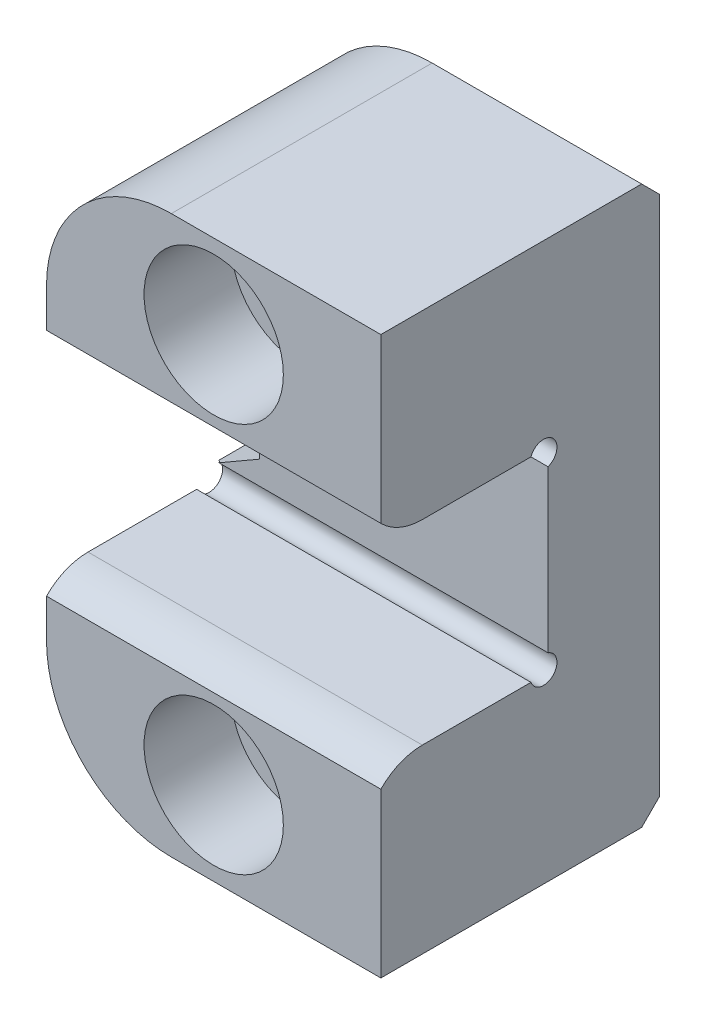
ISO-10303-21;
HEADER;
FILE_DESCRIPTION(('STEP AP214'),'2;1');
FILE_NAME('part.step','',(''),(''),'','','');
FILE_SCHEMA(('AUTOMOTIVE_DESIGN { 1 0 10303 214 1 1 1 1 }'));
ENDSEC;
DATA;
#1=APPLICATION_CONTEXT('core data for automotive mechanical design processes');
#2=APPLICATION_PROTOCOL_DEFINITION('international standard','automotive_design',2000,#1);
#3=PRODUCT_CONTEXT('',#1,'mechanical');
#4=PRODUCT('Part','Part','',(#3));
#5=PRODUCT_RELATED_PRODUCT_CATEGORY('part','',(#4));
#6=PRODUCT_DEFINITION_FORMATION('','',#4);
#7=PRODUCT_DEFINITION_CONTEXT('part definition',#1,'design');
#8=PRODUCT_DEFINITION('design','',#6,#7);
#9=PRODUCT_DEFINITION_SHAPE('','',#8);
#10=(LENGTH_UNIT() NAMED_UNIT(*) SI_UNIT(.MILLI.,.METRE.));
#11=(NAMED_UNIT(*) PLANE_ANGLE_UNIT() SI_UNIT($,.RADIAN.));
#12=(NAMED_UNIT(*) SI_UNIT($,.STERADIAN.) SOLID_ANGLE_UNIT());
#13=UNCERTAINTY_MEASURE_WITH_UNIT(LENGTH_MEASURE(1.E-05),#10,'distance_accuracy_value','');
#14=(GEOMETRIC_REPRESENTATION_CONTEXT(3) GLOBAL_UNCERTAINTY_ASSIGNED_CONTEXT((#13)) GLOBAL_UNIT_ASSIGNED_CONTEXT((#10,
#11,#12)) REPRESENTATION_CONTEXT('',''));
#15=CARTESIAN_POINT('',(0.,0.,0.));
#16=DIRECTION('',(0.,0.,1.));
#17=DIRECTION('',(1.,0.,0.));
#18=AXIS2_PLACEMENT_3D('',#15,#16,#17);
#19=CARTESIAN_POINT('',(9.525,5.5626,-9.525));
#20=DIRECTION('',(0.,0.,-1.));
#21=DIRECTION('',(-1.,0.,0.));
#22=AXIS2_PLACEMENT_3D('',#19,#20,#21);
#23=PLANE('',#22);
#24=DIRECTION('',(-0.866025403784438,0.500000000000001,0.));
#25=VECTOR('',#24,1.);
#26=CARTESIAN_POINT('',(4.41604653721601,-3.28636697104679,-9.525));
#27=LINE('',#26,#25);
#28=CARTESIAN_POINT('',(-6.91661357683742,3.25654739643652,-9.525));
#29=VERTEX_POINT('',#28);
#30=CARTESIAN_POINT('',(-9.22653215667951,4.59017951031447,-9.525));
#31=VERTEX_POINT('',#30);
#32=EDGE_CURVE('E342',#29,#31,#27,.T.);
#33=ORIENTED_EDGE('',*,*,#32,.F.);
#34=DIRECTION('',(0.,-1.,0.));
#35=VECTOR('',#34,1.);
#36=CARTESIAN_POINT('',(-6.91661357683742,-3.84595644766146,-9.525));
#37=LINE('',#36,#35);
#38=CARTESIAN_POINT('',(-6.91661357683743,-3.25654739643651,-9.525));
#39=VERTEX_POINT('',#38);
#40=EDGE_CURVE('E257',#29,#39,#37,.T.);
#41=ORIENTED_EDGE('',*,*,#40,.T.);
#42=DIRECTION('',(0.866025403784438,0.500000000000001,0.));
#43=VECTOR('',#42,1.);
#44=CARTESIAN_POINT('',(9.23339944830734,6.06766697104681,-9.525));
#45=LINE('',#44,#43);
#46=CARTESIAN_POINT('',(-9.22653215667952,-4.59017951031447,-9.525));
#47=VERTEX_POINT('',#46);
#48=EDGE_CURVE('E340',#47,#39,#45,.T.);
#49=ORIENTED_EDGE('',*,*,#48,.F.);
#50=DIRECTION('',(1.,0.,0.));
#51=VECTOR('',#50,1.);
#52=CARTESIAN_POINT('',(-9.525,-4.59017951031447,-9.525));
#53=LINE('',#52,#51);
#54=CARTESIAN_POINT('',(9.525,-4.59017951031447,-9.525));
#55=VERTEX_POINT('',#54);
#56=EDGE_CURVE('E200',#47,#55,#53,.T.);
#57=ORIENTED_EDGE('',*,*,#56,.T.);
#58=DIRECTION('',(0.,-1.,0.));
#59=VECTOR('',#58,1.);
#60=CARTESIAN_POINT('',(9.525,5.5626,-9.525));
#61=LINE('',#60,#59);
#62=CARTESIAN_POINT('',(9.525,4.59017951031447,-9.525));
#63=VERTEX_POINT('',#62);
#64=EDGE_CURVE('E350',#63,#55,#61,.T.);
#65=ORIENTED_EDGE('',*,*,#64,.F.);
#66=DIRECTION('',(1.,0.,0.));
#67=VECTOR('',#66,1.);
#68=CARTESIAN_POINT('',(-9.525,4.59017951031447,-9.525));
#69=LINE('',#68,#67);
#70=EDGE_CURVE('E413',#63,#31,#69,.F.);
#71=ORIENTED_EDGE('',*,*,#70,.T.);
#72=EDGE_LOOP('',(#33,#41,#49,#57,#65,#71));
#73=FACE_BOUND('',#72,.T.);
#74=ADVANCED_FACE('F32',(#73),#23,.F.);
#75=CARTESIAN_POINT('',(9.525,15.875,-15.875));
#76=DIRECTION('',(0.,0.,1.));
#77=DIRECTION('',(0.,-1.,0.));
#78=AXIS2_PLACEMENT_3D('',#75,#76,#77);
#79=PLANE('',#78);
#80=CARTESIAN_POINT('',(0.,11.1125,-15.875));
#81=DIRECTION('',(0.,0.,1.));
#82=DIRECTION('',(1.,0.,0.));
#83=AXIS2_PLACEMENT_3D('',#80,#81,#82);
#84=CIRCLE('',#83,2.45745);
#85=CARTESIAN_POINT('',(2.45745,11.1125,-15.875));
#86=VERTEX_POINT('',#85);
#87=EDGE_CURVE('E548',#86,#86,#84,.T.);
#88=ORIENTED_EDGE('',*,*,#87,.T.);
#89=EDGE_LOOP('',(#88));
#90=FACE_BOUND('',#89,.T.);
#91=CARTESIAN_POINT('',(0.,-11.1125,-15.875));
#92=DIRECTION('',(0.,0.,1.));
#93=DIRECTION('',(1.,0.,0.));
#94=AXIS2_PLACEMENT_3D('',#91,#92,#93);
#95=CIRCLE('',#94,2.45745);
#96=CARTESIAN_POINT('',(2.45745,-11.1125,-15.875));
#97=VERTEX_POINT('',#96);
#98=EDGE_CURVE('E560',#97,#97,#95,.T.);
#99=ORIENTED_EDGE('',*,*,#98,.T.);
#100=EDGE_LOOP('',(#99));
#101=FACE_BOUND('',#100,.T.);
#102=CARTESIAN_POINT('',(-2.413,-8.763,-15.875));
#103=DIRECTION('',(0.,0.,1.));
#104=DIRECTION('',(0.,-1.,0.));
#105=AXIS2_PLACEMENT_3D('',#102,#103,#104);
#106=CIRCLE('',#105,6.09600000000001);
#107=CARTESIAN_POINT('',(-2.413,-14.859,-15.875));
#108=VERTEX_POINT('',#107);
#109=CARTESIAN_POINT('',(-8.50900000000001,-8.763,-15.875));
#110=VERTEX_POINT('',#109);
#111=EDGE_CURVE('E273',#108,#110,#106,.F.);
#112=ORIENTED_EDGE('',*,*,#111,.T.);
#113=DIRECTION('',(0.,1.,0.));
#114=VECTOR('',#113,1.);
#115=CARTESIAN_POINT('',(-8.50900000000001,15.875,-15.875));
#116=LINE('',#115,#114);
#117=CARTESIAN_POINT('',(-8.50900000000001,-4.17591212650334,-15.875));
#118=VERTEX_POINT('',#117);
#119=EDGE_CURVE('E275',#110,#118,#116,.T.);
#120=ORIENTED_EDGE('',*,*,#119,.T.);
#121=DIRECTION('',(0.866025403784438,0.500000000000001,0.));
#122=VECTOR('',#121,1.);
#123=CARTESIAN_POINT('',(-7.9375,-3.84595644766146,-15.875));
#124=LINE('',#123,#122);
#125=CARTESIAN_POINT('',(-7.9375,-3.84595644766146,-15.875));
#126=VERTEX_POINT('',#125);
#127=EDGE_CURVE('E326',#118,#126,#124,.T.);
#128=ORIENTED_EDGE('',*,*,#127,.T.);
#129=DIRECTION('',(0.,1.,0.));
#130=VECTOR('',#129,1.);
#131=CARTESIAN_POINT('',(-7.9375,3.84595644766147,-15.875));
#132=LINE('',#131,#130);
#133=CARTESIAN_POINT('',(-7.9375,3.84595644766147,-15.875));
#134=VERTEX_POINT('',#133);
#135=EDGE_CURVE('E325',#126,#134,#132,.T.);
#136=ORIENTED_EDGE('',*,*,#135,.T.);
#137=DIRECTION('',(-0.866025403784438,0.500000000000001,0.));
#138=VECTOR('',#137,1.);
#139=CARTESIAN_POINT('',(-7.9375,3.84595644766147,-15.875));
#140=LINE('',#139,#138);
#141=CARTESIAN_POINT('',(-8.50900000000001,4.17591212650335,-15.875));
#142=VERTEX_POINT('',#141);
#143=EDGE_CURVE('E319',#134,#142,#140,.T.);
#144=ORIENTED_EDGE('',*,*,#143,.T.);
#145=DIRECTION('',(0.,1.,0.));
#146=VECTOR('',#145,1.);
#147=CARTESIAN_POINT('',(-8.50900000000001,15.875,-15.875));
#148=LINE('',#147,#146);
#149=CARTESIAN_POINT('',(-8.50900000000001,8.763,-15.875));
#150=VERTEX_POINT('',#149);
#151=EDGE_CURVE('E267',#142,#150,#148,.T.);
#152=ORIENTED_EDGE('',*,*,#151,.T.);
#153=CARTESIAN_POINT('',(-2.413,8.763,-15.875));
#154=DIRECTION('',(0.,0.,1.));
#155=DIRECTION('',(0.,-1.,0.));
#156=AXIS2_PLACEMENT_3D('',#153,#154,#155);
#157=CIRCLE('',#156,6.09600000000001);
#158=CARTESIAN_POINT('',(-2.413,14.859,-15.875));
#159=VERTEX_POINT('',#158);
#160=EDGE_CURVE('E265',#150,#159,#157,.F.);
#161=ORIENTED_EDGE('',*,*,#160,.T.);
#162=DIRECTION('',(1.,0.,0.));
#163=VECTOR('',#162,1.);
#164=CARTESIAN_POINT('',(9.525,14.859,-15.875));
#165=LINE('',#164,#163);
#166=CARTESIAN_POINT('',(9.525,14.859,-15.875));
#167=VERTEX_POINT('',#166);
#168=EDGE_CURVE('E269',#159,#167,#165,.T.);
#169=ORIENTED_EDGE('',*,*,#168,.T.);
#170=DIRECTION('',(0.,1.,0.));
#171=VECTOR('',#170,1.);
#172=CARTESIAN_POINT('',(9.525,15.875,-15.875));
#173=LINE('',#172,#171);
#174=CARTESIAN_POINT('',(9.525,-14.859,-15.875));
#175=VERTEX_POINT('',#174);
#176=EDGE_CURVE('E359',#175,#167,#173,.T.);
#177=ORIENTED_EDGE('',*,*,#176,.F.);
#178=DIRECTION('',(-1.,0.,0.));
#179=VECTOR('',#178,1.);
#180=CARTESIAN_POINT('',(9.525,-14.859,-15.875));
#181=LINE('',#180,#179);
#182=EDGE_CURVE('E271',#175,#108,#181,.T.);
#183=ORIENTED_EDGE('',*,*,#182,.T.);
#184=EDGE_LOOP('',(#112,#120,#128,#136,#144,#152,#161,#169,#177,#183));
#185=FACE_BOUND('',#184,.T.);
#186=ADVANCED_FACE('F323',(#90,#101,#185),#79,.F.);
#187=CARTESIAN_POINT('',(-9.525,15.875,0.));
#188=DIRECTION('',(1.,0.,0.));
#189=DIRECTION('',(0.,0.,-1.));
#190=AXIS2_PLACEMENT_3D('',#187,#188,#189);
#191=PLANE('',#190);
#192=DIRECTION('',(0.,0.,1.));
#193=VECTOR('',#192,1.);
#194=CARTESIAN_POINT('',(-9.525,8.763,0.));
#195=LINE('',#194,#193);
#196=CARTESIAN_POINT('',(-9.525,8.763,0.));
#197=VERTEX_POINT('',#196);
#198=CARTESIAN_POINT('',(-9.525,8.763,-14.859));
#199=VERTEX_POINT('',#198);
#200=EDGE_CURVE('E237',#197,#199,#195,.F.);
#201=ORIENTED_EDGE('',*,*,#200,.T.);
#202=DIRECTION('',(0.,-1.,0.));
#203=VECTOR('',#202,1.);
#204=CARTESIAN_POINT('',(-9.525,15.875,-14.859));
#205=LINE('',#204,#203);
#206=CARTESIAN_POINT('',(-9.525,4.76250000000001,-14.859));
#207=VERTEX_POINT('',#206);
#208=EDGE_CURVE('E54',#199,#207,#205,.T.);
#209=ORIENTED_EDGE('',*,*,#208,.T.);
#210=DIRECTION('',(0.,0.,-1.));
#211=VECTOR('',#210,1.);
#212=CARTESIAN_POINT('',(-9.525,4.76250000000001,0.));
#213=LINE('',#212,#211);
#214=CARTESIAN_POINT('',(-9.525,4.76250000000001,-9.80243088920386));
#215=VERTEX_POINT('',#214);
#216=EDGE_CURVE('E249',#215,#207,#213,.T.);
#217=ORIENTED_EDGE('',*,*,#216,.F.);
#218=CARTESIAN_POINT('',(-9.525,5.3086,-9.271));
#219=DIRECTION('',(1.,0.,0.));
#220=DIRECTION('',(0.,0.,-1.));
#221=AXIS2_PLACEMENT_3D('',#218,#219,#220);
#222=CIRCLE('',#221,0.762000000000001);
#223=CARTESIAN_POINT('',(-9.525,5.5626,-8.55257951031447));
#224=VERTEX_POINT('',#223);
#225=EDGE_CURVE('E417',#215,#224,#222,.T.);
#226=ORIENTED_EDGE('',*,*,#225,.T.);
#227=DIRECTION('',(0.,0.,-1.));
#228=VECTOR('',#227,1.);
#229=CARTESIAN_POINT('',(-9.525,5.5626,0.));
#230=LINE('',#229,#228);
#231=CARTESIAN_POINT('',(-9.525,5.5626,-2.36219999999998));
#232=VERTEX_POINT('',#231);
#233=EDGE_CURVE('E217',#232,#224,#230,.T.);
#234=ORIENTED_EDGE('',*,*,#233,.F.);
#235=CARTESIAN_POINT('',(-9.525,8.8617534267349,-2.36219999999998));
#236=DIRECTION('',(-1.,0.,0.));
#237=DIRECTION('',(0.,0.,-1.));
#238=AXIS2_PLACEMENT_3D('',#235,#236,#237);
#239=CIRCLE('',#238,3.2991534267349);
#240=CARTESIAN_POINT('',(-9.525,6.5586198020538,0.));
#241=VERTEX_POINT('',#240);
#242=EDGE_CURVE('E373',#232,#241,#239,.T.);
#243=ORIENTED_EDGE('',*,*,#242,.T.);
#244=DIRECTION('',(0.,-1.,0.));
#245=VECTOR('',#244,1.);
#246=CARTESIAN_POINT('',(-9.525,15.875,0.));
#247=LINE('',#246,#245);
#248=EDGE_CURVE('E223',#197,#241,#247,.T.);
#249=ORIENTED_EDGE('',*,*,#248,.F.);
#250=EDGE_LOOP('',(#201,#209,#217,#226,#234,#243,#249));
#251=FACE_BOUND('',#250,.T.);
#252=ADVANCED_FACE('F371',(#251),#191,.F.);
#253=DIRECTION('',(0.,0.,1.));
#254=VECTOR('',#253,1.);
#255=CARTESIAN_POINT('',(-9.525,-4.7625,0.));
#256=LINE('',#255,#254);
#257=CARTESIAN_POINT('',(-9.525,-4.7625,-14.859));
#258=VERTEX_POINT('',#257);
#259=CARTESIAN_POINT('',(-9.525,-4.7625,-9.80243088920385));
#260=VERTEX_POINT('',#259);
#261=EDGE_CURVE('E247',#258,#260,#256,.T.);
#262=ORIENTED_EDGE('',*,*,#261,.F.);
#263=DIRECTION('',(0.,-1.,0.));
#264=VECTOR('',#263,1.);
#265=CARTESIAN_POINT('',(-9.525,15.875,-14.859));
#266=LINE('',#265,#264);
#267=CARTESIAN_POINT('',(-9.525,-8.763,-14.859));
#268=VERTEX_POINT('',#267);
#269=EDGE_CURVE('E280',#258,#268,#266,.T.);
#270=ORIENTED_EDGE('',*,*,#269,.T.);
#271=DIRECTION('',(0.,0.,-1.));
#272=VECTOR('',#271,1.);
#273=CARTESIAN_POINT('',(-9.525,-8.763,0.));
#274=LINE('',#273,#272);
#275=CARTESIAN_POINT('',(-9.525,-8.763,0.));
#276=VERTEX_POINT('',#275);
#277=EDGE_CURVE('E239',#268,#276,#274,.F.);
#278=ORIENTED_EDGE('',*,*,#277,.T.);
#279=DIRECTION('',(0.,-1.,0.));
#280=VECTOR('',#279,1.);
#281=CARTESIAN_POINT('',(-9.525,-5.5626,0.));
#282=LINE('',#281,#280);
#283=CARTESIAN_POINT('',(-9.525,-6.5586198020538,0.));
#284=VERTEX_POINT('',#283);
#285=EDGE_CURVE('E216',#284,#276,#282,.T.);
#286=ORIENTED_EDGE('',*,*,#285,.F.);
#287=CARTESIAN_POINT('',(-9.525,-8.8617534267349,-2.36219999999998));
#288=DIRECTION('',(-1.,0.,0.));
#289=DIRECTION('',(0.,0.,1.));
#290=AXIS2_PLACEMENT_3D('',#287,#288,#289);
#291=CIRCLE('',#290,3.2991534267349);
#292=CARTESIAN_POINT('',(-9.525,-5.5626,-2.36219999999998));
#293=VERTEX_POINT('',#292);
#294=EDGE_CURVE('E215',#284,#293,#291,.T.);
#295=ORIENTED_EDGE('',*,*,#294,.T.);
#296=DIRECTION('',(0.,0.,1.));
#297=VECTOR('',#296,1.);
#298=CARTESIAN_POINT('',(-9.525,-5.5626,-9.525));
#299=LINE('',#298,#297);
#300=CARTESIAN_POINT('',(-9.525,-5.5626,-8.55257951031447));
#301=VERTEX_POINT('',#300);
#302=EDGE_CURVE('E207',#301,#293,#299,.T.);
#303=ORIENTED_EDGE('',*,*,#302,.F.);
#304=CARTESIAN_POINT('',(-9.525,-5.3086,-9.271));
#305=DIRECTION('',(1.,0.,0.));
#306=DIRECTION('',(0.,0.,1.));
#307=AXIS2_PLACEMENT_3D('',#304,#305,#306);
#308=CIRCLE('',#307,0.762000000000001);
#309=EDGE_CURVE('E190',#301,#260,#308,.T.);
#310=ORIENTED_EDGE('',*,*,#309,.T.);
#311=EDGE_LOOP('',(#262,#270,#278,#286,#295,#303,#310));
#312=FACE_BOUND('',#311,.T.);
#313=ADVANCED_FACE('F213',(#312),#191,.F.);
#314=CARTESIAN_POINT('',(9.525,15.875,0.));
#315=DIRECTION('',(0.,0.,-1.));
#316=DIRECTION('',(0.,1.,0.));
#317=AXIS2_PLACEMENT_3D('',#314,#315,#316);
#318=PLANE('',#317);
#319=CARTESIAN_POINT('',(0.,11.1125,0.));
#320=DIRECTION('',(0.,0.,1.));
#321=DIRECTION('',(1.,0.,0.));
#322=AXIS2_PLACEMENT_3D('',#319,#320,#321);
#323=CIRCLE('',#322,3.96875);
#324=CARTESIAN_POINT('',(3.96875,11.1125,0.));
#325=VERTEX_POINT('',#324);
#326=EDGE_CURVE('E300',#325,#325,#323,.T.);
#327=ORIENTED_EDGE('',*,*,#326,.F.);
#328=EDGE_LOOP('',(#327));
#329=FACE_BOUND('',#328,.T.);
#330=ORIENTED_EDGE('',*,*,#248,.T.);
#331=DIRECTION('',(1.,0.,0.));
#332=VECTOR('',#331,1.);
#333=CARTESIAN_POINT('',(-9.525,6.5586198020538,0.));
#334=LINE('',#333,#332);
#335=CARTESIAN_POINT('',(9.525,6.5586198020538,0.));
#336=VERTEX_POINT('',#335);
#337=EDGE_CURVE('E368',#241,#336,#334,.T.);
#338=ORIENTED_EDGE('',*,*,#337,.T.);
#339=DIRECTION('',(0.,-1.,0.));
#340=VECTOR('',#339,1.);
#341=CARTESIAN_POINT('',(9.525,15.875,0.));
#342=LINE('',#341,#340);
#343=CARTESIAN_POINT('',(9.525,15.875,0.));
#344=VERTEX_POINT('',#343);
#345=EDGE_CURVE('E220',#344,#336,#342,.T.);
#346=ORIENTED_EDGE('',*,*,#345,.F.);
#347=DIRECTION('',(-1.,0.,0.));
#348=VECTOR('',#347,1.);
#349=CARTESIAN_POINT('',(9.525,15.875,0.));
#350=LINE('',#349,#348);
#351=CARTESIAN_POINT('',(-2.413,15.875,0.));
#352=VERTEX_POINT('',#351);
#353=EDGE_CURVE('E227',#344,#352,#350,.T.);
#354=ORIENTED_EDGE('',*,*,#353,.T.);
#355=CARTESIAN_POINT('',(-2.413,8.763,0.));
#356=DIRECTION('',(0.,0.,-1.));
#357=DIRECTION('',(0.,1.,0.));
#358=AXIS2_PLACEMENT_3D('',#355,#356,#357);
#359=CIRCLE('',#358,7.112);
#360=EDGE_CURVE('E245',#352,#197,#359,.F.);
#361=ORIENTED_EDGE('',*,*,#360,.T.);
#362=EDGE_LOOP('',(#330,#338,#346,#354,#361));
#363=FACE_BOUND('',#362,.T.);
#364=ADVANCED_FACE('F366',(#329,#363),#318,.F.);
#365=CARTESIAN_POINT('',(9.525,5.5626,0.));
#366=DIRECTION('',(0.,1.,0.));
#367=DIRECTION('',(0.,0.,1.));
#368=AXIS2_PLACEMENT_3D('',#365,#366,#367);
#369=PLANE('',#368);
#370=ORIENTED_EDGE('',*,*,#233,.T.);
#371=DIRECTION('',(1.,0.,0.));
#372=VECTOR('',#371,1.);
#373=CARTESIAN_POINT('',(-9.525,5.5626,-8.55257951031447));
#374=LINE('',#373,#372);
#375=CARTESIAN_POINT('',(9.525,5.5626,-8.55257951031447));
#376=VERTEX_POINT('',#375);
#377=EDGE_CURVE('E416',#224,#376,#374,.T.);
#378=ORIENTED_EDGE('',*,*,#377,.T.);
#379=DIRECTION('',(0.,0.,-1.));
#380=VECTOR('',#379,1.);
#381=CARTESIAN_POINT('',(9.525,5.5626,0.));
#382=LINE('',#381,#380);
#383=CARTESIAN_POINT('',(9.525,5.5626,-2.36219999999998));
#384=VERTEX_POINT('',#383);
#385=EDGE_CURVE('E347',#384,#376,#382,.T.);
#386=ORIENTED_EDGE('',*,*,#385,.F.);
#387=DIRECTION('',(1.,0.,0.));
#388=VECTOR('',#387,1.);
#389=CARTESIAN_POINT('',(-9.525,5.5626,-2.36219999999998));
#390=LINE('',#389,#388);
#391=EDGE_CURVE('E428',#232,#384,#390,.T.);
#392=ORIENTED_EDGE('',*,*,#391,.F.);
#393=EDGE_LOOP('',(#370,#378,#386,#392));
#394=FACE_BOUND('',#393,.T.);
#395=ADVANCED_FACE('F470',(#394),#369,.F.);
#396=CARTESIAN_POINT('',(9.525,-5.5626,-9.525));
#397=DIRECTION('',(0.,-1.,0.));
#398=DIRECTION('',(0.,0.,-1.));
#399=AXIS2_PLACEMENT_3D('',#396,#397,#398);
#400=PLANE('',#399);
#401=DIRECTION('',(0.,0.,1.));
#402=VECTOR('',#401,1.);
#403=CARTESIAN_POINT('',(9.525,-5.5626,-9.525));
#404=LINE('',#403,#402);
#405=CARTESIAN_POINT('',(9.525,-5.5626,-8.55257951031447));
#406=VERTEX_POINT('',#405);
#407=CARTESIAN_POINT('',(9.525,-5.5626,-2.36219999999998));
#408=VERTEX_POINT('',#407);
#409=EDGE_CURVE('E209',#406,#408,#404,.T.);
#410=ORIENTED_EDGE('',*,*,#409,.F.);
#411=DIRECTION('',(1.,0.,0.));
#412=VECTOR('',#411,1.);
#413=CARTESIAN_POINT('',(-9.525,-5.5626,-8.55257951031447));
#414=LINE('',#413,#412);
#415=EDGE_CURVE('E193',#406,#301,#414,.F.);
#416=ORIENTED_EDGE('',*,*,#415,.T.);
#417=ORIENTED_EDGE('',*,*,#302,.T.);
#418=DIRECTION('',(1.,0.,0.));
#419=VECTOR('',#418,1.);
#420=CARTESIAN_POINT('',(-9.525,-5.5626,-2.36219999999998));
#421=LINE('',#420,#419);
#422=EDGE_CURVE('E330',#293,#408,#421,.T.);
#423=ORIENTED_EDGE('',*,*,#422,.T.);
#424=EDGE_LOOP('',(#410,#416,#417,#423));
#425=FACE_BOUND('',#424,.T.);
#426=ADVANCED_FACE('F205',(#425),#400,.F.);
#427=CARTESIAN_POINT('',(9.525,-5.5626,0.));
#428=DIRECTION('',(0.,0.,-1.));
#429=DIRECTION('',(0.,1.,0.));
#430=AXIS2_PLACEMENT_3D('',#427,#428,#429);
#431=PLANE('',#430);
#432=CARTESIAN_POINT('',(0.,-11.1125,0.));
#433=DIRECTION('',(0.,0.,1.));
#434=DIRECTION('',(1.,0.,0.));
#435=AXIS2_PLACEMENT_3D('',#432,#433,#434);
#436=CIRCLE('',#435,3.96875);
#437=CARTESIAN_POINT('',(3.96875,-11.1125,0.));
#438=VERTEX_POINT('',#437);
#439=EDGE_CURVE('E545',#438,#438,#436,.T.);
#440=ORIENTED_EDGE('',*,*,#439,.F.);
#441=EDGE_LOOP('',(#440));
#442=FACE_BOUND('',#441,.T.);
#443=DIRECTION('',(0.,-1.,0.));
#444=VECTOR('',#443,1.);
#445=CARTESIAN_POINT('',(9.525,-5.5626,0.));
#446=LINE('',#445,#444);
#447=CARTESIAN_POINT('',(9.525,-6.5586198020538,0.));
#448=VERTEX_POINT('',#447);
#449=CARTESIAN_POINT('',(9.525,-15.875,0.));
#450=VERTEX_POINT('',#449);
#451=EDGE_CURVE('E354',#448,#450,#446,.T.);
#452=ORIENTED_EDGE('',*,*,#451,.F.);
#453=DIRECTION('',(1.,0.,0.));
#454=VECTOR('',#453,1.);
#455=CARTESIAN_POINT('',(-9.525,-6.5586198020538,0.));
#456=LINE('',#455,#454);
#457=EDGE_CURVE('E327',#284,#448,#456,.T.);
#458=ORIENTED_EDGE('',*,*,#457,.F.);
#459=ORIENTED_EDGE('',*,*,#285,.T.);
#460=CARTESIAN_POINT('',(-2.413,-8.763,0.));
#461=DIRECTION('',(0.,0.,-1.));
#462=DIRECTION('',(0.,1.,0.));
#463=AXIS2_PLACEMENT_3D('',#460,#461,#462);
#464=CIRCLE('',#463,7.112);
#465=CARTESIAN_POINT('',(-2.413,-15.875,0.));
#466=VERTEX_POINT('',#465);
#467=EDGE_CURVE('E241',#276,#466,#464,.F.);
#468=ORIENTED_EDGE('',*,*,#467,.T.);
#469=DIRECTION('',(-1.,0.,0.));
#470=VECTOR('',#469,1.);
#471=CARTESIAN_POINT('',(9.525,-15.875,0.));
#472=LINE('',#471,#470);
#473=EDGE_CURVE('E230',#450,#466,#472,.T.);
#474=ORIENTED_EDGE('',*,*,#473,.F.);
#475=EDGE_LOOP('',(#452,#458,#459,#468,#474));
#476=FACE_BOUND('',#475,.T.);
#477=ADVANCED_FACE('F441',(#442,#476),#431,.F.);
#478=CARTESIAN_POINT('',(9.525,-15.875,0.));
#479=DIRECTION('',(0.,1.,0.));
#480=DIRECTION('',(0.,0.,1.));
#481=AXIS2_PLACEMENT_3D('',#478,#479,#480);
#482=PLANE('',#481);
#483=DIRECTION('',(0.,0.,-1.));
#484=VECTOR('',#483,1.);
#485=CARTESIAN_POINT('',(-2.413,-15.875,0.));
#486=LINE('',#485,#484);
#487=CARTESIAN_POINT('',(-2.413,-15.875,-14.859));
#488=VERTEX_POINT('',#487);
#489=EDGE_CURVE('E234',#466,#488,#486,.T.);
#490=ORIENTED_EDGE('',*,*,#489,.T.);
#491=DIRECTION('',(1.,0.,0.));
#492=VECTOR('',#491,1.);
#493=CARTESIAN_POINT('',(9.525,-15.875,-14.859));
#494=LINE('',#493,#492);
#495=CARTESIAN_POINT('',(9.525,-15.875,-14.859));
#496=VERTEX_POINT('',#495);
#497=EDGE_CURVE('E284',#488,#496,#494,.T.);
#498=ORIENTED_EDGE('',*,*,#497,.T.);
#499=DIRECTION('',(0.,0.,-1.));
#500=VECTOR('',#499,1.);
#501=CARTESIAN_POINT('',(9.525,-15.875,0.));
#502=LINE('',#501,#500);
#503=EDGE_CURVE('E356',#450,#496,#502,.T.);
#504=ORIENTED_EDGE('',*,*,#503,.F.);
#505=ORIENTED_EDGE('',*,*,#473,.T.);
#506=EDGE_LOOP('',(#490,#498,#504,#505));
#507=FACE_BOUND('',#506,.T.);
#508=ADVANCED_FACE('F446',(#507),#482,.F.);
#509=CARTESIAN_POINT('',(9.525,15.875,0.));
#510=DIRECTION('',(0.,-1.,0.));
#511=DIRECTION('',(0.,0.,-1.));
#512=AXIS2_PLACEMENT_3D('',#509,#510,#511);
#513=PLANE('',#512);
#514=DIRECTION('',(0.,0.,1.));
#515=VECTOR('',#514,1.);
#516=CARTESIAN_POINT('',(9.525,15.875,0.));
#517=LINE('',#516,#515);
#518=CARTESIAN_POINT('',(9.525,15.875,-14.859));
#519=VERTEX_POINT('',#518);
#520=EDGE_CURVE('E231',#519,#344,#517,.T.);
#521=ORIENTED_EDGE('',*,*,#520,.F.);
#522=DIRECTION('',(-1.,0.,0.));
#523=VECTOR('',#522,1.);
#524=CARTESIAN_POINT('',(9.525,15.875,-14.859));
#525=LINE('',#524,#523);
#526=CARTESIAN_POINT('',(-2.413,15.875,-14.859));
#527=VERTEX_POINT('',#526);
#528=EDGE_CURVE('E290',#519,#527,#525,.T.);
#529=ORIENTED_EDGE('',*,*,#528,.T.);
#530=DIRECTION('',(0.,0.,1.));
#531=VECTOR('',#530,1.);
#532=CARTESIAN_POINT('',(-2.413,15.875,0.));
#533=LINE('',#532,#531);
#534=EDGE_CURVE('E243',#527,#352,#533,.T.);
#535=ORIENTED_EDGE('',*,*,#534,.T.);
#536=ORIENTED_EDGE('',*,*,#353,.F.);
#537=EDGE_LOOP('',(#521,#529,#535,#536));
#538=FACE_BOUND('',#537,.T.);
#539=ADVANCED_FACE('F378',(#538),#513,.F.);
#540=CARTESIAN_POINT('',(9.525,15.875,0.));
#541=DIRECTION('',(1.,0.,0.));
#542=DIRECTION('',(0.,0.,-1.));
#543=AXIS2_PLACEMENT_3D('',#540,#541,#542);
#544=PLANE('',#543);
#545=ORIENTED_EDGE('',*,*,#503,.T.);
#546=DIRECTION('',(0.,-0.707106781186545,0.70710678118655));
#547=VECTOR('',#546,1.);
#548=CARTESIAN_POINT('',(9.525,-7.4295000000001,-23.3044999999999));
#549=LINE('',#548,#547);
#550=EDGE_CURVE('E288',#496,#175,#549,.F.);
#551=ORIENTED_EDGE('',*,*,#550,.T.);
#552=ORIENTED_EDGE('',*,*,#176,.T.);
#553=DIRECTION('',(0.,-0.707106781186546,-0.707106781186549));
#554=VECTOR('',#553,1.);
#555=CARTESIAN_POINT('',(9.525,23.3045,-7.42949999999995));
#556=LINE('',#555,#554);
#557=EDGE_CURVE('E286',#167,#519,#556,.F.);
#558=ORIENTED_EDGE('',*,*,#557,.T.);
#559=ORIENTED_EDGE('',*,*,#520,.T.);
#560=ORIENTED_EDGE('',*,*,#345,.T.);
#561=CARTESIAN_POINT('',(9.525,8.8617534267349,-2.36219999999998));
#562=DIRECTION('',(-1.,0.,0.));
#563=DIRECTION('',(0.,0.,-1.));
#564=AXIS2_PLACEMENT_3D('',#561,#562,#563);
#565=CIRCLE('',#564,3.2991534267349);
#566=EDGE_CURVE('E420',#384,#336,#565,.T.);
#567=ORIENTED_EDGE('',*,*,#566,.F.);
#568=ORIENTED_EDGE('',*,*,#385,.T.);
#569=CARTESIAN_POINT('',(9.525,5.3086,-9.271));
#570=DIRECTION('',(1.,0.,0.));
#571=DIRECTION('',(0.,0.,-1.));
#572=AXIS2_PLACEMENT_3D('',#569,#570,#571);
#573=CIRCLE('',#572,0.762000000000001);
#574=EDGE_CURVE('E210',#63,#376,#573,.T.);
#575=ORIENTED_EDGE('',*,*,#574,.F.);
#576=ORIENTED_EDGE('',*,*,#64,.T.);
#577=CARTESIAN_POINT('',(9.525,-5.3086,-9.271));
#578=DIRECTION('',(1.,0.,0.));
#579=DIRECTION('',(0.,0.,1.));
#580=AXIS2_PLACEMENT_3D('',#577,#578,#579);
#581=CIRCLE('',#580,0.762000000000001);
#582=EDGE_CURVE('E201',#406,#55,#581,.T.);
#583=ORIENTED_EDGE('',*,*,#582,.F.);
#584=ORIENTED_EDGE('',*,*,#409,.T.);
#585=CARTESIAN_POINT('',(9.525,-8.8617534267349,-2.36219999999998));
#586=DIRECTION('',(-1.,0.,0.));
#587=DIRECTION('',(0.,0.,1.));
#588=AXIS2_PLACEMENT_3D('',#585,#586,#587);
#589=CIRCLE('',#588,3.2991534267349);
#590=EDGE_CURVE('E430',#448,#408,#589,.T.);
#591=ORIENTED_EDGE('',*,*,#590,.F.);
#592=ORIENTED_EDGE('',*,*,#451,.T.);
#593=EDGE_LOOP('',(#545,#551,#552,#558,#559,#560,#567,#568,#575,#576,#583,#584,#591,#592));
#594=FACE_BOUND('',#593,.T.);
#595=ADVANCED_FACE('F382',(#594),#544,.T.);
#596=CARTESIAN_POINT('',(-2.413,-8.763,0.));
#597=DIRECTION('',(0.,0.,-1.));
#598=DIRECTION('',(-1.,0.,0.));
#599=AXIS2_PLACEMENT_3D('',#596,#597,#598);
#600=CYLINDRICAL_SURFACE('',#599,7.112);
#601=ORIENTED_EDGE('',*,*,#277,.F.);
#602=CARTESIAN_POINT('',(-2.413,-8.763,-14.859));
#603=DIRECTION('',(0.,0.,1.));
#604=DIRECTION('',(1.,0.,0.));
#605=AXIS2_PLACEMENT_3D('',#602,#603,#604);
#606=CIRCLE('',#605,7.112);
#607=EDGE_CURVE('E282',#268,#488,#606,.T.);
#608=ORIENTED_EDGE('',*,*,#607,.T.);
#609=ORIENTED_EDGE('',*,*,#489,.F.);
#610=ORIENTED_EDGE('',*,*,#467,.F.);
#611=EDGE_LOOP('',(#601,#608,#609,#610));
#612=FACE_BOUND('',#611,.T.);
#613=ADVANCED_FACE('F449',(#612),#600,.T.);
#614=CARTESIAN_POINT('',(-2.413,8.763,0.));
#615=DIRECTION('',(0.,0.,1.));
#616=DIRECTION('',(0.,-1.,0.));
#617=AXIS2_PLACEMENT_3D('',#614,#615,#616);
#618=CYLINDRICAL_SURFACE('',#617,7.112);
#619=ORIENTED_EDGE('',*,*,#534,.F.);
#620=CARTESIAN_POINT('',(-2.413,8.763,-14.859));
#621=DIRECTION('',(0.,0.,1.));
#622=DIRECTION('',(1.,0.,0.));
#623=AXIS2_PLACEMENT_3D('',#620,#621,#622);
#624=CIRCLE('',#623,7.112);
#625=EDGE_CURVE('E11',#527,#199,#624,.T.);
#626=ORIENTED_EDGE('',*,*,#625,.T.);
#627=ORIENTED_EDGE('',*,*,#200,.F.);
#628=ORIENTED_EDGE('',*,*,#360,.F.);
#629=EDGE_LOOP('',(#619,#626,#627,#628));
#630=FACE_BOUND('',#629,.T.);
#631=ADVANCED_FACE('F374',(#630),#618,.T.);
#632=CARTESIAN_POINT('',(-7.9375,3.84595644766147,0.));
#633=DIRECTION('',(-1.,0.,0.));
#634=DIRECTION('',(0.,0.,1.));
#635=AXIS2_PLACEMENT_3D('',#632,#633,#634);
#636=PLANE('',#635);
#637=DIRECTION('',(0.,0.,-1.));
#638=VECTOR('',#637,1.);
#639=CARTESIAN_POINT('',(-7.9375,-3.84595644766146,0.));
#640=LINE('',#639,#638);
#641=CARTESIAN_POINT('',(-7.9375,-3.84595644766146,-13.335));
#642=VERTEX_POINT('',#641);
#643=EDGE_CURVE('E337',#642,#126,#640,.T.);
#644=ORIENTED_EDGE('',*,*,#643,.F.);
#645=DIRECTION('',(0.,1.,0.));
#646=VECTOR('',#645,1.);
#647=CARTESIAN_POINT('',(-7.9375,3.84595644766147,-13.335));
#648=LINE('',#647,#646);
#649=CARTESIAN_POINT('',(-7.9375,3.84595644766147,-13.335));
#650=VERTEX_POINT('',#649);
#651=EDGE_CURVE('E254',#642,#650,#648,.T.);
#652=ORIENTED_EDGE('',*,*,#651,.T.);
#653=DIRECTION('',(0.,0.,-1.));
#654=VECTOR('',#653,1.);
#655=CARTESIAN_POINT('',(-7.9375,3.84595644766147,0.));
#656=LINE('',#655,#654);
#657=EDGE_CURVE('E335',#650,#134,#656,.T.);
#658=ORIENTED_EDGE('',*,*,#657,.T.);
#659=ORIENTED_EDGE('',*,*,#135,.F.);
#660=EDGE_LOOP('',(#644,#652,#658,#659));
#661=FACE_BOUND('',#660,.T.);
#662=ADVANCED_FACE('F404',(#661),#636,.T.);
#663=CARTESIAN_POINT('',(-7.9375,3.84595644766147,0.));
#664=DIRECTION('',(-0.500000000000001,-0.866025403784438,0.));
#665=DIRECTION('',(0.866025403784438,-0.500000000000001,0.));
#666=AXIS2_PLACEMENT_3D('',#663,#664,#665);
#667=PLANE('',#666);
#668=ORIENTED_EDGE('',*,*,#216,.T.);
#669=DIRECTION('',(-0.654653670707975,0.377964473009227,0.654653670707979));
#670=VECTOR('',#669,1.);
#671=CARTESIAN_POINT('',(-14.986,7.91540982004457,-9.39799999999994));
#672=LINE('',#671,#670);
#673=EDGE_CURVE('E41',#207,#142,#672,.F.);
#674=ORIENTED_EDGE('',*,*,#673,.T.);
#675=ORIENTED_EDGE('',*,*,#143,.F.);
#676=ORIENTED_EDGE('',*,*,#657,.F.);
#677=DIRECTION('',(0.255976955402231,-0.147788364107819,0.955319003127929));
#678=VECTOR('',#677,1.);
#679=CARTESIAN_POINT('',(-7.9375,3.84595644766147,-13.335));
#680=LINE('',#679,#678);
#681=EDGE_CURVE('E260',#650,#29,#680,.T.);
#682=ORIENTED_EDGE('',*,*,#681,.T.);
#683=ORIENTED_EDGE('',*,*,#32,.T.);
#684=CARTESIAN_POINT('',(-10.4708729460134,5.3086,-9.271));
#685=DIRECTION('',(-0.500000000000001,-0.866025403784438,0.));
#686=DIRECTION('',(0.866025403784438,-0.500000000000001,0.));
#687=AXIS2_PLACEMENT_3D('',#684,#685,#686);
#688=ELLIPSE('',#687,1.524,0.762000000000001);
#689=EDGE_CURVE('E251',#215,#31,#688,.T.);
#690=ORIENTED_EDGE('',*,*,#689,.F.);
#691=EDGE_LOOP('',(#668,#674,#675,#676,#682,#683,#690));
#692=FACE_BOUND('',#691,.T.);
#693=ADVANCED_FACE('F317',(#692),#667,.T.);
#694=CARTESIAN_POINT('',(-7.9375,-3.84595644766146,0.));
#695=DIRECTION('',(-0.500000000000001,0.866025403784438,0.));
#696=DIRECTION('',(-0.866025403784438,-0.500000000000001,0.));
#697=AXIS2_PLACEMENT_3D('',#694,#695,#696);
#698=PLANE('',#697);
#699=ORIENTED_EDGE('',*,*,#127,.F.);
#700=DIRECTION('',(0.654653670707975,0.377964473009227,-0.654653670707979));
#701=VECTOR('',#700,1.);
#702=CARTESIAN_POINT('',(-14.986,-7.91540982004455,-9.39799999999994));
#703=LINE('',#702,#701);
#704=EDGE_CURVE('E278',#118,#258,#703,.F.);
#705=ORIENTED_EDGE('',*,*,#704,.T.);
#706=ORIENTED_EDGE('',*,*,#261,.T.);
#707=CARTESIAN_POINT('',(-10.4708729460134,-5.3086,-9.271));
#708=DIRECTION('',(-0.500000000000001,0.866025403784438,0.));
#709=DIRECTION('',(0.866025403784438,0.500000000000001,0.));
#710=AXIS2_PLACEMENT_3D('',#707,#708,#709);
#711=ELLIPSE('',#710,1.524,0.762000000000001);
#712=EDGE_CURVE('E196',#47,#260,#711,.T.);
#713=ORIENTED_EDGE('',*,*,#712,.F.);
#714=ORIENTED_EDGE('',*,*,#48,.T.);
#715=DIRECTION('',(-0.255976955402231,-0.147788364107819,-0.955319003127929));
#716=VECTOR('',#715,1.);
#717=CARTESIAN_POINT('',(-7.64651173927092,-3.67795429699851,-12.249017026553));
#718=LINE('',#717,#716);
#719=EDGE_CURVE('E263',#39,#642,#718,.T.);
#720=ORIENTED_EDGE('',*,*,#719,.T.);
#721=ORIENTED_EDGE('',*,*,#643,.T.);
#722=EDGE_LOOP('',(#699,#705,#706,#713,#714,#720,#721));
#723=FACE_BOUND('',#722,.T.);
#724=ADVANCED_FACE('F399',(#723),#698,.T.);
#725=CARTESIAN_POINT('',(-9.525,-8.8617534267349,-2.36219999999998));
#726=DIRECTION('',(1.,0.,0.));
#727=DIRECTION('',(0.,0.,-1.));
#728=AXIS2_PLACEMENT_3D('',#725,#726,#727);
#729=CYLINDRICAL_SURFACE('',#728,3.2991534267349);
#730=ORIENTED_EDGE('',*,*,#590,.T.);
#731=ORIENTED_EDGE('',*,*,#422,.F.);
#732=ORIENTED_EDGE('',*,*,#294,.F.);
#733=ORIENTED_EDGE('',*,*,#457,.T.);
#734=EDGE_LOOP('',(#730,#731,#732,#733));
#735=FACE_BOUND('',#734,.T.);
#736=ADVANCED_FACE('F436',(#735),#729,.T.);
#737=CARTESIAN_POINT('',(-9.525,8.8617534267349,-2.36219999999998));
#738=DIRECTION('',(1.,0.,0.));
#739=DIRECTION('',(0.,0.,-1.));
#740=AXIS2_PLACEMENT_3D('',#737,#738,#739);
#741=CYLINDRICAL_SURFACE('',#740,3.2991534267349);
#742=ORIENTED_EDGE('',*,*,#566,.T.);
#743=ORIENTED_EDGE('',*,*,#337,.F.);
#744=ORIENTED_EDGE('',*,*,#242,.F.);
#745=ORIENTED_EDGE('',*,*,#391,.T.);
#746=EDGE_LOOP('',(#742,#743,#744,#745));
#747=FACE_BOUND('',#746,.T.);
#748=ADVANCED_FACE('F519',(#747),#741,.T.);
#749=CARTESIAN_POINT('',(-9.525,5.3086,-9.271));
#750=DIRECTION('',(1.,0.,0.));
#751=DIRECTION('',(0.,0.,-1.));
#752=AXIS2_PLACEMENT_3D('',#749,#750,#751);
#753=CYLINDRICAL_SURFACE('',#752,0.762000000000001);
#754=ORIENTED_EDGE('',*,*,#225,.F.);
#755=ORIENTED_EDGE('',*,*,#689,.T.);
#756=ORIENTED_EDGE('',*,*,#70,.F.);
#757=ORIENTED_EDGE('',*,*,#574,.T.);
#758=ORIENTED_EDGE('',*,*,#377,.F.);
#759=EDGE_LOOP('',(#754,#755,#756,#757,#758));
#760=FACE_BOUND('',#759,.T.);
#761=ADVANCED_FACE('F516',(#760),#753,.F.);
#762=CARTESIAN_POINT('',(-9.525,-5.3086,-9.271));
#763=DIRECTION('',(1.,0.,0.));
#764=DIRECTION('',(0.,0.,-1.));
#765=AXIS2_PLACEMENT_3D('',#762,#763,#764);
#766=CYLINDRICAL_SURFACE('',#765,0.762000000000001);
#767=ORIENTED_EDGE('',*,*,#582,.T.);
#768=ORIENTED_EDGE('',*,*,#56,.F.);
#769=ORIENTED_EDGE('',*,*,#712,.T.);
#770=ORIENTED_EDGE('',*,*,#309,.F.);
#771=ORIENTED_EDGE('',*,*,#415,.F.);
#772=EDGE_LOOP('',(#767,#768,#769,#770,#771));
#773=FACE_BOUND('',#772,.T.);
#774=ADVANCED_FACE('F192',(#773),#766,.F.);
#775=CARTESIAN_POINT('',(0.,-11.1125,0.));
#776=DIRECTION('',(0.,0.,1.));
#777=DIRECTION('',(1.,0.,0.));
#778=AXIS2_PLACEMENT_3D('',#775,#776,#777);
#779=CYLINDRICAL_SURFACE('',#778,2.45745);
#780=ORIENTED_EDGE('',*,*,#98,.F.);
#781=EDGE_LOOP('',(#780));
#782=FACE_BOUND('',#781,.T.);
#783=CARTESIAN_POINT('',(0.,-11.1125,-4.96062));
#784=DIRECTION('',(0.,0.,1.));
#785=DIRECTION('',(1.,0.,0.));
#786=AXIS2_PLACEMENT_3D('',#783,#784,#785);
#787=CIRCLE('',#786,2.45745);
#788=CARTESIAN_POINT('',(2.45745,-11.1125,-4.96062));
#789=VERTEX_POINT('',#788);
#790=EDGE_CURVE('E551',#789,#789,#787,.T.);
#791=ORIENTED_EDGE('',*,*,#790,.T.);
#792=EDGE_LOOP('',(#791));
#793=FACE_BOUND('',#792,.T.);
#794=ADVANCED_FACE('F509',(#782,#793),#779,.F.);
#795=CARTESIAN_POINT('',(2.45745,-11.1125,-4.96062));
#796=DIRECTION('',(0.,0.,-1.));
#797=DIRECTION('',(-1.,0.,0.));
#798=AXIS2_PLACEMENT_3D('',#795,#796,#797);
#799=PLANE('',#798);
#800=ORIENTED_EDGE('',*,*,#790,.F.);
#801=EDGE_LOOP('',(#800));
#802=FACE_BOUND('',#801,.T.);
#803=CARTESIAN_POINT('',(0.,-11.1125,-4.96062));
#804=DIRECTION('',(0.,0.,1.));
#805=DIRECTION('',(1.,0.,0.));
#806=AXIS2_PLACEMENT_3D('',#803,#804,#805);
#807=CIRCLE('',#806,3.96875);
#808=CARTESIAN_POINT('',(3.96875,-11.1125,-4.96062));
#809=VERTEX_POINT('',#808);
#810=EDGE_CURVE('E547',#809,#809,#807,.T.);
#811=ORIENTED_EDGE('',*,*,#810,.T.);
#812=EDGE_LOOP('',(#811));
#813=FACE_BOUND('',#812,.T.);
#814=ADVANCED_FACE('F505',(#802,#813),#799,.F.);
#815=CARTESIAN_POINT('',(0.,-11.1125,0.));
#816=DIRECTION('',(0.,0.,1.));
#817=DIRECTION('',(1.,0.,0.));
#818=AXIS2_PLACEMENT_3D('',#815,#816,#817);
#819=CYLINDRICAL_SURFACE('',#818,3.96875);
#820=ORIENTED_EDGE('',*,*,#810,.F.);
#821=EDGE_LOOP('',(#820));
#822=FACE_BOUND('',#821,.T.);
#823=ORIENTED_EDGE('',*,*,#439,.T.);
#824=EDGE_LOOP('',(#823));
#825=FACE_BOUND('',#824,.T.);
#826=ADVANCED_FACE('F501',(#822,#825),#819,.F.);
#827=CARTESIAN_POINT('',(0.,11.1125,0.));
#828=DIRECTION('',(0.,0.,1.));
#829=DIRECTION('',(1.,0.,0.));
#830=AXIS2_PLACEMENT_3D('',#827,#828,#829);
#831=CYLINDRICAL_SURFACE('',#830,2.45745);
#832=ORIENTED_EDGE('',*,*,#87,.F.);
#833=EDGE_LOOP('',(#832));
#834=FACE_BOUND('',#833,.T.);
#835=CARTESIAN_POINT('',(0.,11.1125,-4.96062));
#836=DIRECTION('',(0.,0.,1.));
#837=DIRECTION('',(1.,0.,0.));
#838=AXIS2_PLACEMENT_3D('',#835,#836,#837);
#839=CIRCLE('',#838,2.45745);
#840=CARTESIAN_POINT('',(2.45745,11.1125,-4.96062));
#841=VERTEX_POINT('',#840);
#842=EDGE_CURVE('E554',#841,#841,#839,.T.);
#843=ORIENTED_EDGE('',*,*,#842,.T.);
#844=EDGE_LOOP('',(#843));
#845=FACE_BOUND('',#844,.T.);
#846=ADVANCED_FACE('F493',(#834,#845),#831,.F.);
#847=CARTESIAN_POINT('',(2.45745,11.1125,-4.96062));
#848=DIRECTION('',(0.,0.,-1.));
#849=DIRECTION('',(-1.,0.,0.));
#850=AXIS2_PLACEMENT_3D('',#847,#848,#849);
#851=PLANE('',#850);
#852=ORIENTED_EDGE('',*,*,#842,.F.);
#853=EDGE_LOOP('',(#852));
#854=FACE_BOUND('',#853,.T.);
#855=CARTESIAN_POINT('',(0.,11.1125,-4.96062));
#856=DIRECTION('',(0.,0.,1.));
#857=DIRECTION('',(1.,0.,0.));
#858=AXIS2_PLACEMENT_3D('',#855,#856,#857);
#859=CIRCLE('',#858,3.96875);
#860=CARTESIAN_POINT('',(3.96875,11.1125,-4.96062));
#861=VERTEX_POINT('',#860);
#862=EDGE_CURVE('E575',#861,#861,#859,.T.);
#863=ORIENTED_EDGE('',*,*,#862,.T.);
#864=EDGE_LOOP('',(#863));
#865=FACE_BOUND('',#864,.T.);
#866=ADVANCED_FACE('F487',(#854,#865),#851,.F.);
#867=CARTESIAN_POINT('',(0.,11.1125,0.));
#868=DIRECTION('',(0.,0.,1.));
#869=DIRECTION('',(1.,0.,0.));
#870=AXIS2_PLACEMENT_3D('',#867,#868,#869);
#871=CYLINDRICAL_SURFACE('',#870,3.96875);
#872=ORIENTED_EDGE('',*,*,#862,.F.);
#873=EDGE_LOOP('',(#872));
#874=FACE_BOUND('',#873,.T.);
#875=ORIENTED_EDGE('',*,*,#326,.T.);
#876=EDGE_LOOP('',(#875));
#877=FACE_BOUND('',#876,.T.);
#878=ADVANCED_FACE('F481',(#874,#877),#871,.F.);
#879=CARTESIAN_POINT('',(-7.9375,3.84595644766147,-13.335));
#880=DIRECTION('',(-0.965925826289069,0.,0.258819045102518));
#881=DIRECTION('',(0.258819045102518,0.,0.965925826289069));
#882=AXIS2_PLACEMENT_3D('',#879,#880,#881);
#883=PLANE('',#882);
#884=ORIENTED_EDGE('',*,*,#719,.F.);
#885=ORIENTED_EDGE('',*,*,#40,.F.);
#886=ORIENTED_EDGE('',*,*,#681,.F.);
#887=ORIENTED_EDGE('',*,*,#651,.F.);
#888=EDGE_LOOP('',(#884,#885,#886,#887));
#889=FACE_BOUND('',#888,.T.);
#890=ADVANCED_FACE('F407',(#889),#883,.T.);
#891=CARTESIAN_POINT('',(9.525,-14.859,-15.875));
#892=DIRECTION('',(0.,0.70710678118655,0.707106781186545));
#893=DIRECTION('',(0.,-0.707106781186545,0.70710678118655));
#894=AXIS2_PLACEMENT_3D('',#891,#892,#893);
#895=PLANE('',#894);
#896=ORIENTED_EDGE('',*,*,#550,.F.);
#897=ORIENTED_EDGE('',*,*,#497,.F.);
#898=DIRECTION('',(0.,-0.707106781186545,0.70710678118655));
#899=VECTOR('',#898,1.);
#900=CARTESIAN_POINT('',(-2.413,-14.859,-15.875));
#901=LINE('',#900,#899);
#902=EDGE_CURVE('E298',#108,#488,#901,.T.);
#903=ORIENTED_EDGE('',*,*,#902,.F.);
#904=ORIENTED_EDGE('',*,*,#182,.F.);
#905=EDGE_LOOP('',(#896,#897,#903,#904));
#906=FACE_BOUND('',#905,.T.);
#907=ADVANCED_FACE('F388',(#906),#895,.F.);
#908=CARTESIAN_POINT('',(-2.413,-8.763,-15.875));
#909=DIRECTION('',(0.,0.,1.));
#910=DIRECTION('',(1.,0.,0.));
#911=AXIS2_PLACEMENT_3D('',#908,#909,#910);
#912=CONICAL_SURFACE('',#911,6.09600000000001,0.785398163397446);
#913=ORIENTED_EDGE('',*,*,#902,.T.);
#914=ORIENTED_EDGE('',*,*,#607,.F.);
#915=DIRECTION('',(-0.707106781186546,0.,0.707106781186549));
#916=VECTOR('',#915,1.);
#917=CARTESIAN_POINT('',(-8.50900000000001,-8.763,-15.875));
#918=LINE('',#917,#916);
#919=EDGE_CURVE('E295',#110,#268,#918,.T.);
#920=ORIENTED_EDGE('',*,*,#919,.F.);
#921=ORIENTED_EDGE('',*,*,#111,.F.);
#922=EDGE_LOOP('',(#913,#914,#920,#921));
#923=FACE_BOUND('',#922,.T.);
#924=ADVANCED_FACE('F394',(#923),#912,.T.);
#925=CARTESIAN_POINT('',(-8.50900000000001,15.875,-15.875));
#926=DIRECTION('',(0.70710678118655,0.,0.707106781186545));
#927=DIRECTION('',(0.707106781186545,0.,-0.70710678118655));
#928=AXIS2_PLACEMENT_3D('',#925,#926,#927);
#929=PLANE('',#928);
#930=ORIENTED_EDGE('',*,*,#919,.T.);
#931=ORIENTED_EDGE('',*,*,#269,.F.);
#932=ORIENTED_EDGE('',*,*,#704,.F.);
#933=ORIENTED_EDGE('',*,*,#119,.F.);
#934=EDGE_LOOP('',(#930,#931,#932,#933));
#935=FACE_BOUND('',#934,.T.);
#936=ADVANCED_FACE('F451',(#935),#929,.F.);
#937=CARTESIAN_POINT('',(-8.50900000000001,15.875,-15.875));
#938=DIRECTION('',(0.70710678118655,0.,0.707106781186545));
#939=DIRECTION('',(0.707106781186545,0.,-0.70710678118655));
#940=AXIS2_PLACEMENT_3D('',#937,#938,#939);
#941=PLANE('',#940);
#942=ORIENTED_EDGE('',*,*,#673,.F.);
#943=ORIENTED_EDGE('',*,*,#208,.F.);
#944=DIRECTION('',(-0.707106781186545,0.,0.70710678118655));
#945=VECTOR('',#944,1.);
#946=CARTESIAN_POINT('',(-8.50900000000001,8.763,-15.875));
#947=LINE('',#946,#945);
#948=EDGE_CURVE('E36',#150,#199,#947,.T.);
#949=ORIENTED_EDGE('',*,*,#948,.F.);
#950=ORIENTED_EDGE('',*,*,#151,.F.);
#951=EDGE_LOOP('',(#942,#943,#949,#950));
#952=FACE_BOUND('',#951,.T.);
#953=ADVANCED_FACE('F34',(#952),#941,.F.);
#954=CARTESIAN_POINT('',(-2.413,8.763,-15.875));
#955=DIRECTION('',(0.,0.,1.));
#956=DIRECTION('',(1.,0.,0.));
#957=AXIS2_PLACEMENT_3D('',#954,#955,#956);
#958=CONICAL_SURFACE('',#957,6.09600000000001,0.785398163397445);
#959=ORIENTED_EDGE('',*,*,#948,.T.);
#960=ORIENTED_EDGE('',*,*,#625,.F.);
#961=DIRECTION('',(0.,0.707106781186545,0.70710678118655));
#962=VECTOR('',#961,1.);
#963=CARTESIAN_POINT('',(-2.413,14.859,-15.875));
#964=LINE('',#963,#962);
#965=EDGE_CURVE('E301',#159,#527,#964,.T.);
#966=ORIENTED_EDGE('',*,*,#965,.F.);
#967=ORIENTED_EDGE('',*,*,#160,.F.);
#968=EDGE_LOOP('',(#959,#960,#966,#967));
#969=FACE_BOUND('',#968,.T.);
#970=ADVANCED_FACE('F310',(#969),#958,.T.);
#971=CARTESIAN_POINT('',(9.525,15.875,-14.859));
#972=DIRECTION('',(0.,-0.707106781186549,0.707106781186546));
#973=DIRECTION('',(0.,-0.707106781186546,-0.707106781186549));
#974=AXIS2_PLACEMENT_3D('',#971,#972,#973);
#975=PLANE('',#974);
#976=ORIENTED_EDGE('',*,*,#557,.F.);
#977=ORIENTED_EDGE('',*,*,#168,.F.);
#978=ORIENTED_EDGE('',*,*,#965,.T.);
#979=ORIENTED_EDGE('',*,*,#528,.F.);
#980=EDGE_LOOP('',(#976,#977,#978,#979));
#981=FACE_BOUND('',#980,.T.);
#982=ADVANCED_FACE('F380',(#981),#975,.F.);
#983=CLOSED_SHELL('',(#74,#186,#252,#313,#364,#395,#426,#477,#508,#539,#595,#613,#631,#662,#693,
#724,#736,#748,#761,#774,#794,#814,#826,#846,#866,#878,#890,#907,#924,#936,#953,#970,#982));
#984=MANIFOLD_SOLID_BREP('B2',#983);
#985=ADVANCED_BREP_SHAPE_REPRESENTATION('',(#18,#984),#14);
#986=SHAPE_DEFINITION_REPRESENTATION(#9,#985);
ENDSEC;
END-ISO-10303-21;
